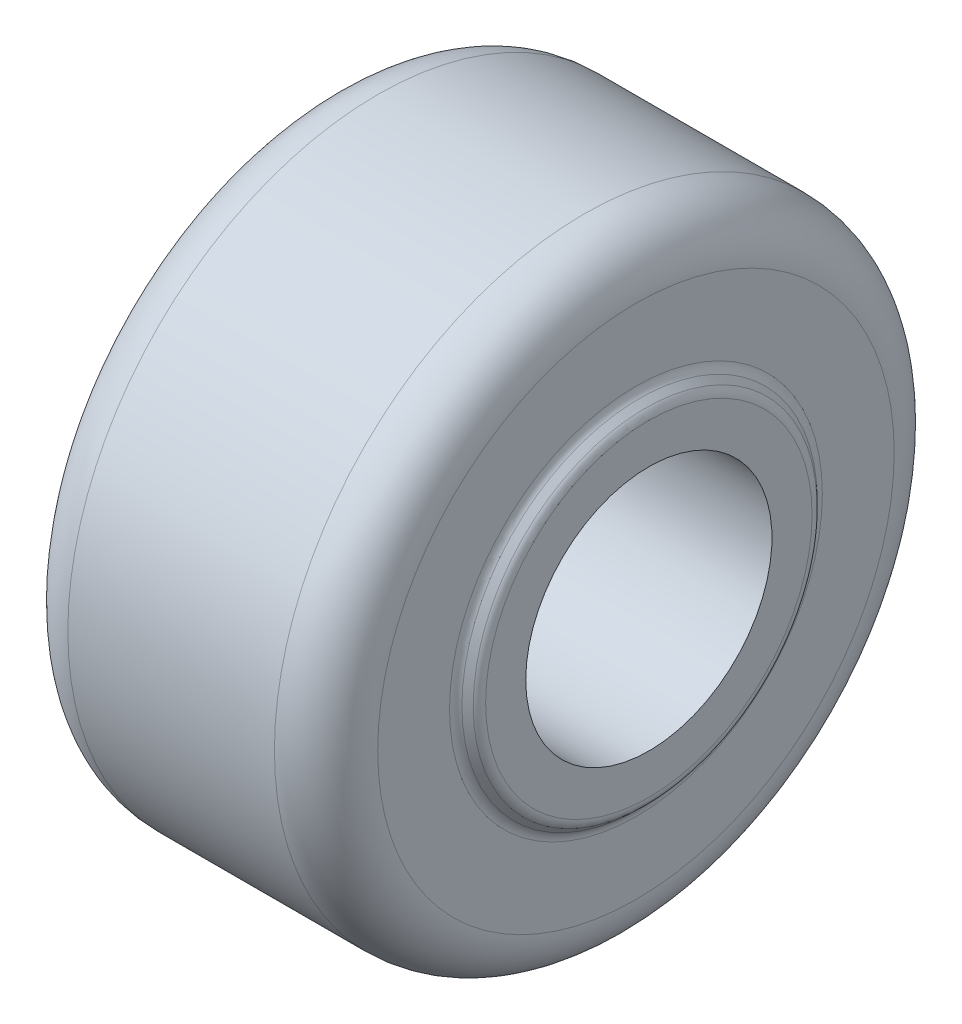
ISO-10303-21;
HEADER;
FILE_DESCRIPTION(('STEP AP214'),'2;1');
FILE_NAME('part.step','',(''),(''),'','','');
FILE_SCHEMA(('AUTOMOTIVE_DESIGN { 1 0 10303 214 1 1 1 1 }'));
ENDSEC;
DATA;
#1=APPLICATION_CONTEXT('core data for automotive mechanical design processes');
#2=APPLICATION_PROTOCOL_DEFINITION('international standard','automotive_design',2000,#1);
#3=PRODUCT_CONTEXT('',#1,'mechanical');
#4=PRODUCT('Part','Part','',(#3));
#5=PRODUCT_RELATED_PRODUCT_CATEGORY('part','',(#4));
#6=PRODUCT_DEFINITION_FORMATION('','',#4);
#7=PRODUCT_DEFINITION_CONTEXT('part definition',#1,'design');
#8=PRODUCT_DEFINITION('design','',#6,#7);
#9=PRODUCT_DEFINITION_SHAPE('','',#8);
#10=(LENGTH_UNIT() NAMED_UNIT(*) SI_UNIT(.MILLI.,.METRE.));
#11=(NAMED_UNIT(*) PLANE_ANGLE_UNIT() SI_UNIT($,.RADIAN.));
#12=(NAMED_UNIT(*) SI_UNIT($,.STERADIAN.) SOLID_ANGLE_UNIT());
#13=UNCERTAINTY_MEASURE_WITH_UNIT(LENGTH_MEASURE(1.E-05),#10,'distance_accuracy_value','');
#14=(GEOMETRIC_REPRESENTATION_CONTEXT(3) GLOBAL_UNCERTAINTY_ASSIGNED_CONTEXT((#13)) GLOBAL_UNIT_ASSIGNED_CONTEXT((#10,
#11,#12)) REPRESENTATION_CONTEXT('',''));
#15=CARTESIAN_POINT('',(0.,0.,0.));
#16=DIRECTION('',(0.,0.,1.));
#17=DIRECTION('',(1.,0.,0.));
#18=AXIS2_PLACEMENT_3D('',#15,#16,#17);
#19=CARTESIAN_POINT('',(-20.6375,20.0697385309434,0.));
#20=DIRECTION('',(1.,0.,0.));
#21=DIRECTION('',(0.,0.,-1.));
#22=AXIS2_PLACEMENT_3D('',#19,#20,#21);
#23=PLANE('',#22);
#24=CARTESIAN_POINT('',(-20.6375,0.,0.));
#25=DIRECTION('',(-1.,0.,0.));
#26=DIRECTION('',(0.,0.,1.));
#27=AXIS2_PLACEMENT_3D('',#24,#25,#26);
#28=CIRCLE('',#27,15.1384);
#29=CARTESIAN_POINT('',(-20.6375,0.,15.1384));
#30=VERTEX_POINT('',#29);
#31=EDGE_CURVE('E10',#30,#30,#28,.T.);
#32=ORIENTED_EDGE('',*,*,#31,.F.);
#33=EDGE_LOOP('',(#32));
#34=FACE_BOUND('',#33,.T.);
#35=CARTESIAN_POINT('',(-20.6375,0.,0.));
#36=DIRECTION('',(-1.,0.,0.));
#37=DIRECTION('',(0.,0.,1.));
#38=AXIS2_PLACEMENT_3D('',#35,#36,#37);
#39=CIRCLE('',#38,20.0697385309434);
#40=CARTESIAN_POINT('',(-20.6375,0.,20.0697385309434));
#41=VERTEX_POINT('',#40);
#42=EDGE_CURVE('E406',#41,#41,#39,.T.);
#43=ORIENTED_EDGE('',*,*,#42,.T.);
#44=EDGE_LOOP('',(#43));
#45=FACE_BOUND('',#44,.T.);
#46=ADVANCED_FACE('F360',(#34,#45),#23,.F.);
#47=CARTESIAN_POINT('',(-38.862204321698,0.,0.));
#48=DIRECTION('',(-1.,0.,0.));
#49=DIRECTION('',(0.,0.,1.));
#50=AXIS2_PLACEMENT_3D('',#47,#48,#49);
#51=CYLINDRICAL_SURFACE('',#50,15.1384);
#52=CARTESIAN_POINT('',(20.6375,0.,0.));
#53=DIRECTION('',(-1.,0.,0.));
#54=DIRECTION('',(0.,0.,1.));
#55=AXIS2_PLACEMENT_3D('',#52,#53,#54);
#56=CIRCLE('',#55,15.1384);
#57=CARTESIAN_POINT('',(20.6375,0.,15.1384));
#58=VERTEX_POINT('',#57);
#59=EDGE_CURVE('E366',#58,#58,#56,.T.);
#60=ORIENTED_EDGE('',*,*,#59,.F.);
#61=EDGE_LOOP('',(#60));
#62=FACE_BOUND('',#61,.T.);
#63=ORIENTED_EDGE('',*,*,#31,.T.);
#64=EDGE_LOOP('',(#63));
#65=FACE_BOUND('',#64,.T.);
#66=ADVANCED_FACE('F479',(#62,#65),#51,.F.);
#67=CARTESIAN_POINT('',(20.6375,15.1384,0.));
#68=DIRECTION('',(-1.,0.,0.));
#69=DIRECTION('',(0.,0.,1.));
#70=AXIS2_PLACEMENT_3D('',#67,#68,#69);
#71=PLANE('',#70);
#72=CARTESIAN_POINT('',(20.6375,0.,0.));
#73=DIRECTION('',(-1.,0.,0.));
#74=DIRECTION('',(0.,0.,1.));
#75=AXIS2_PLACEMENT_3D('',#72,#73,#74);
#76=CIRCLE('',#75,20.0697385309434);
#77=CARTESIAN_POINT('',(20.6375,0.,20.0697385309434));
#78=VERTEX_POINT('',#77);
#79=EDGE_CURVE('E370',#78,#78,#76,.T.);
#80=ORIENTED_EDGE('',*,*,#79,.F.);
#81=EDGE_LOOP('',(#80));
#82=FACE_BOUND('',#81,.T.);
#83=ORIENTED_EDGE('',*,*,#59,.T.);
#84=EDGE_LOOP('',(#83));
#85=FACE_BOUND('',#84,.T.);
#86=ADVANCED_FACE('F474',(#82,#85),#71,.F.);
#87=CARTESIAN_POINT('',(19.1135,0.,0.));
#88=DIRECTION('',(-1.,0.,0.));
#89=DIRECTION('',(0.,0.,1.));
#90=AXIS2_PLACEMENT_3D('',#87,#88,#89);
#91=TOROIDAL_SURFACE('',#90,20.0697385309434,1.524);
#92=CARTESIAN_POINT('',(20.1911307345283,0.,0.));
#93=DIRECTION('',(-1.,0.,0.));
#94=DIRECTION('',(0.,0.,1.));
#95=AXIS2_PLACEMENT_3D('',#92,#93,#94);
#96=CIRCLE('',#95,21.1473692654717);
#97=CARTESIAN_POINT('',(20.1911307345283,0.,21.1473692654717));
#98=VERTEX_POINT('',#97);
#99=EDGE_CURVE('E374',#98,#98,#96,.T.);
#100=ORIENTED_EDGE('',*,*,#99,.F.);
#101=EDGE_LOOP('',(#100));
#102=FACE_BOUND('',#101,.T.);
#103=ORIENTED_EDGE('',*,*,#79,.T.);
#104=EDGE_LOOP('',(#103));
#105=FACE_BOUND('',#104,.T.);
#106=ADVANCED_FACE('F468',(#102,#105),#91,.T.);
#107=CARTESIAN_POINT('',(20.1911307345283,0.,0.));
#108=DIRECTION('',(-1.,0.,0.));
#109=DIRECTION('',(0.,0.,1.));
#110=AXIS2_PLACEMENT_3D('',#107,#108,#109);
#111=CONICAL_SURFACE('',#110,21.1473692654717,0.785398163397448);
#112=CARTESIAN_POINT('',(19.4963692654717,0.,0.));
#113=DIRECTION('',(-1.,0.,0.));
#114=DIRECTION('',(0.,0.,1.));
#115=AXIS2_PLACEMENT_3D('',#112,#113,#114);
#116=CIRCLE('',#115,21.8421307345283);
#117=CARTESIAN_POINT('',(19.4963692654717,0.,21.8421307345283));
#118=VERTEX_POINT('',#117);
#119=EDGE_CURVE('E379',#118,#118,#116,.T.);
#120=ORIENTED_EDGE('',*,*,#119,.F.);
#121=EDGE_LOOP('',(#120));
#122=FACE_BOUND('',#121,.T.);
#123=ORIENTED_EDGE('',*,*,#99,.T.);
#124=EDGE_LOOP('',(#123));
#125=FACE_BOUND('',#124,.T.);
#126=ADVANCED_FACE('F462',(#122,#125),#111,.T.);
#127=CARTESIAN_POINT('',(20.574,0.,0.));
#128=DIRECTION('',(-1.,0.,0.));
#129=DIRECTION('',(0.,0.,1.));
#130=AXIS2_PLACEMENT_3D('',#127,#128,#129);
#131=TOROIDAL_SURFACE('',#130,22.9197614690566,1.524);
#132=CARTESIAN_POINT('',(19.05,0.,0.));
#133=DIRECTION('',(-1.,0.,0.));
#134=DIRECTION('',(0.,0.,1.));
#135=AXIS2_PLACEMENT_3D('',#132,#133,#134);
#136=CIRCLE('',#135,22.9197614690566);
#137=CARTESIAN_POINT('',(19.05,0.,22.9197614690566));
#138=VERTEX_POINT('',#137);
#139=EDGE_CURVE('E382',#138,#138,#136,.T.);
#140=ORIENTED_EDGE('',*,*,#139,.F.);
#141=EDGE_LOOP('',(#140));
#142=FACE_BOUND('',#141,.T.);
#143=ORIENTED_EDGE('',*,*,#119,.T.);
#144=EDGE_LOOP('',(#143));
#145=FACE_BOUND('',#144,.T.);
#146=ADVANCED_FACE('F456',(#142,#145),#131,.F.);
#147=CARTESIAN_POINT('',(19.05,22.9197614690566,0.));
#148=DIRECTION('',(-1.,0.,0.));
#149=DIRECTION('',(0.,0.,1.));
#150=AXIS2_PLACEMENT_3D('',#147,#148,#149);
#151=PLANE('',#150);
#152=CARTESIAN_POINT('',(19.05,0.,0.));
#153=DIRECTION('',(-1.,0.,0.));
#154=DIRECTION('',(0.,0.,1.));
#155=AXIS2_PLACEMENT_3D('',#152,#153,#154);
#156=CIRCLE('',#155,31.75);
#157=CARTESIAN_POINT('',(19.05,0.,31.75));
#158=VERTEX_POINT('',#157);
#159=EDGE_CURVE('E385',#158,#158,#156,.T.);
#160=ORIENTED_EDGE('',*,*,#159,.F.);
#161=EDGE_LOOP('',(#160));
#162=FACE_BOUND('',#161,.T.);
#163=ORIENTED_EDGE('',*,*,#139,.T.);
#164=EDGE_LOOP('',(#163));
#165=FACE_BOUND('',#164,.T.);
#166=ADVANCED_FACE('F450',(#162,#165),#151,.F.);
#167=CARTESIAN_POINT('',(12.7,0.,0.));
#168=DIRECTION('',(-1.,0.,0.));
#169=DIRECTION('',(0.,0.,1.));
#170=AXIS2_PLACEMENT_3D('',#167,#168,#169);
#171=TOROIDAL_SURFACE('',#170,31.75,6.35);
#172=CARTESIAN_POINT('',(12.7,0.,0.));
#173=DIRECTION('',(-1.,0.,0.));
#174=DIRECTION('',(0.,0.,1.));
#175=AXIS2_PLACEMENT_3D('',#172,#173,#174);
#176=CIRCLE('',#175,38.1);
#177=CARTESIAN_POINT('',(12.7,0.,38.1));
#178=VERTEX_POINT('',#177);
#179=EDGE_CURVE('E388',#178,#178,#176,.T.);
#180=ORIENTED_EDGE('',*,*,#179,.F.);
#181=EDGE_LOOP('',(#180));
#182=FACE_BOUND('',#181,.T.);
#183=ORIENTED_EDGE('',*,*,#159,.T.);
#184=EDGE_LOOP('',(#183));
#185=FACE_BOUND('',#184,.T.);
#186=ADVANCED_FACE('F444',(#182,#185),#171,.T.);
#187=CARTESIAN_POINT('',(-38.862204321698,0.,0.));
#188=DIRECTION('',(-1.,0.,0.));
#189=DIRECTION('',(0.,0.,1.));
#190=AXIS2_PLACEMENT_3D('',#187,#188,#189);
#191=CYLINDRICAL_SURFACE('',#190,38.1);
#192=CARTESIAN_POINT('',(-12.7,0.,0.));
#193=DIRECTION('',(-1.,0.,0.));
#194=DIRECTION('',(0.,0.,1.));
#195=AXIS2_PLACEMENT_3D('',#192,#193,#194);
#196=CIRCLE('',#195,38.1);
#197=CARTESIAN_POINT('',(-12.7,0.,38.1));
#198=VERTEX_POINT('',#197);
#199=EDGE_CURVE('E391',#198,#198,#196,.T.);
#200=ORIENTED_EDGE('',*,*,#199,.F.);
#201=EDGE_LOOP('',(#200));
#202=FACE_BOUND('',#201,.T.);
#203=ORIENTED_EDGE('',*,*,#179,.T.);
#204=EDGE_LOOP('',(#203));
#205=FACE_BOUND('',#204,.T.);
#206=ADVANCED_FACE('F438',(#202,#205),#191,.T.);
#207=CARTESIAN_POINT('',(-12.7,0.,0.));
#208=DIRECTION('',(-1.,0.,0.));
#209=DIRECTION('',(0.,0.,1.));
#210=AXIS2_PLACEMENT_3D('',#207,#208,#209);
#211=TOROIDAL_SURFACE('',#210,31.75,6.35);
#212=CARTESIAN_POINT('',(-19.05,0.,0.));
#213=DIRECTION('',(-1.,0.,0.));
#214=DIRECTION('',(0.,0.,1.));
#215=AXIS2_PLACEMENT_3D('',#212,#213,#214);
#216=CIRCLE('',#215,31.75);
#217=CARTESIAN_POINT('',(-19.05,0.,31.75));
#218=VERTEX_POINT('',#217);
#219=EDGE_CURVE('E394',#218,#218,#216,.T.);
#220=ORIENTED_EDGE('',*,*,#219,.F.);
#221=EDGE_LOOP('',(#220));
#222=FACE_BOUND('',#221,.T.);
#223=ORIENTED_EDGE('',*,*,#199,.T.);
#224=EDGE_LOOP('',(#223));
#225=FACE_BOUND('',#224,.T.);
#226=ADVANCED_FACE('F432',(#222,#225),#211,.T.);
#227=CARTESIAN_POINT('',(-19.05,31.75,0.));
#228=DIRECTION('',(1.,0.,0.));
#229=DIRECTION('',(0.,0.,-1.));
#230=AXIS2_PLACEMENT_3D('',#227,#228,#229);
#231=PLANE('',#230);
#232=CARTESIAN_POINT('',(-19.05,0.,0.));
#233=DIRECTION('',(-1.,0.,0.));
#234=DIRECTION('',(0.,0.,1.));
#235=AXIS2_PLACEMENT_3D('',#232,#233,#234);
#236=CIRCLE('',#235,22.9197614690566);
#237=CARTESIAN_POINT('',(-19.05,0.,22.9197614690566));
#238=VERTEX_POINT('',#237);
#239=EDGE_CURVE('E397',#238,#238,#236,.T.);
#240=ORIENTED_EDGE('',*,*,#239,.F.);
#241=EDGE_LOOP('',(#240));
#242=FACE_BOUND('',#241,.T.);
#243=ORIENTED_EDGE('',*,*,#219,.T.);
#244=EDGE_LOOP('',(#243));
#245=FACE_BOUND('',#244,.T.);
#246=ADVANCED_FACE('F426',(#242,#245),#231,.F.);
#247=CARTESIAN_POINT('',(-20.574,0.,0.));
#248=DIRECTION('',(-1.,0.,0.));
#249=DIRECTION('',(0.,0.,1.));
#250=AXIS2_PLACEMENT_3D('',#247,#248,#249);
#251=TOROIDAL_SURFACE('',#250,22.9197614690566,1.524);
#252=CARTESIAN_POINT('',(-19.4963692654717,0.,0.));
#253=DIRECTION('',(-1.,0.,0.));
#254=DIRECTION('',(0.,0.,1.));
#255=AXIS2_PLACEMENT_3D('',#252,#253,#254);
#256=CIRCLE('',#255,21.8421307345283);
#257=CARTESIAN_POINT('',(-19.4963692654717,0.,21.8421307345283));
#258=VERTEX_POINT('',#257);
#259=EDGE_CURVE('E400',#258,#258,#256,.T.);
#260=ORIENTED_EDGE('',*,*,#259,.F.);
#261=EDGE_LOOP('',(#260));
#262=FACE_BOUND('',#261,.T.);
#263=ORIENTED_EDGE('',*,*,#239,.T.);
#264=EDGE_LOOP('',(#263));
#265=FACE_BOUND('',#264,.T.);
#266=ADVANCED_FACE('F420',(#262,#265),#251,.F.);
#267=CARTESIAN_POINT('',(-19.4963692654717,0.,0.));
#268=DIRECTION('',(1.,0.,0.));
#269=DIRECTION('',(0.,0.,-1.));
#270=AXIS2_PLACEMENT_3D('',#267,#268,#269);
#271=CONICAL_SURFACE('',#270,21.8421307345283,0.785398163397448);
#272=CARTESIAN_POINT('',(-20.1911307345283,0.,0.));
#273=DIRECTION('',(-1.,0.,0.));
#274=DIRECTION('',(0.,0.,1.));
#275=AXIS2_PLACEMENT_3D('',#272,#273,#274);
#276=CIRCLE('',#275,21.1473692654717);
#277=CARTESIAN_POINT('',(-20.1911307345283,0.,21.1473692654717));
#278=VERTEX_POINT('',#277);
#279=EDGE_CURVE('E403',#278,#278,#276,.T.);
#280=ORIENTED_EDGE('',*,*,#279,.F.);
#281=EDGE_LOOP('',(#280));
#282=FACE_BOUND('',#281,.T.);
#283=ORIENTED_EDGE('',*,*,#259,.T.);
#284=EDGE_LOOP('',(#283));
#285=FACE_BOUND('',#284,.T.);
#286=ADVANCED_FACE('F414',(#282,#285),#271,.T.);
#287=CARTESIAN_POINT('',(-19.1135,0.,0.));
#288=DIRECTION('',(-1.,0.,0.));
#289=DIRECTION('',(0.,0.,1.));
#290=AXIS2_PLACEMENT_3D('',#287,#288,#289);
#291=TOROIDAL_SURFACE('',#290,20.0697385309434,1.524);
#292=ORIENTED_EDGE('',*,*,#42,.F.);
#293=EDGE_LOOP('',(#292));
#294=FACE_BOUND('',#293,.T.);
#295=ORIENTED_EDGE('',*,*,#279,.T.);
#296=EDGE_LOOP('',(#295));
#297=FACE_BOUND('',#296,.T.);
#298=ADVANCED_FACE('F411',(#294,#297),#291,.T.);
#299=CLOSED_SHELL('',(#46,#66,#86,#106,#126,#146,#166,#186,#206,#226,#246,#266,#286,#298));
#300=MANIFOLD_SOLID_BREP('B2',#299);
#301=ADVANCED_BREP_SHAPE_REPRESENTATION('',(#18,#300),#14);
#302=SHAPE_DEFINITION_REPRESENTATION(#9,#301);
ENDSEC;
END-ISO-10303-21;
